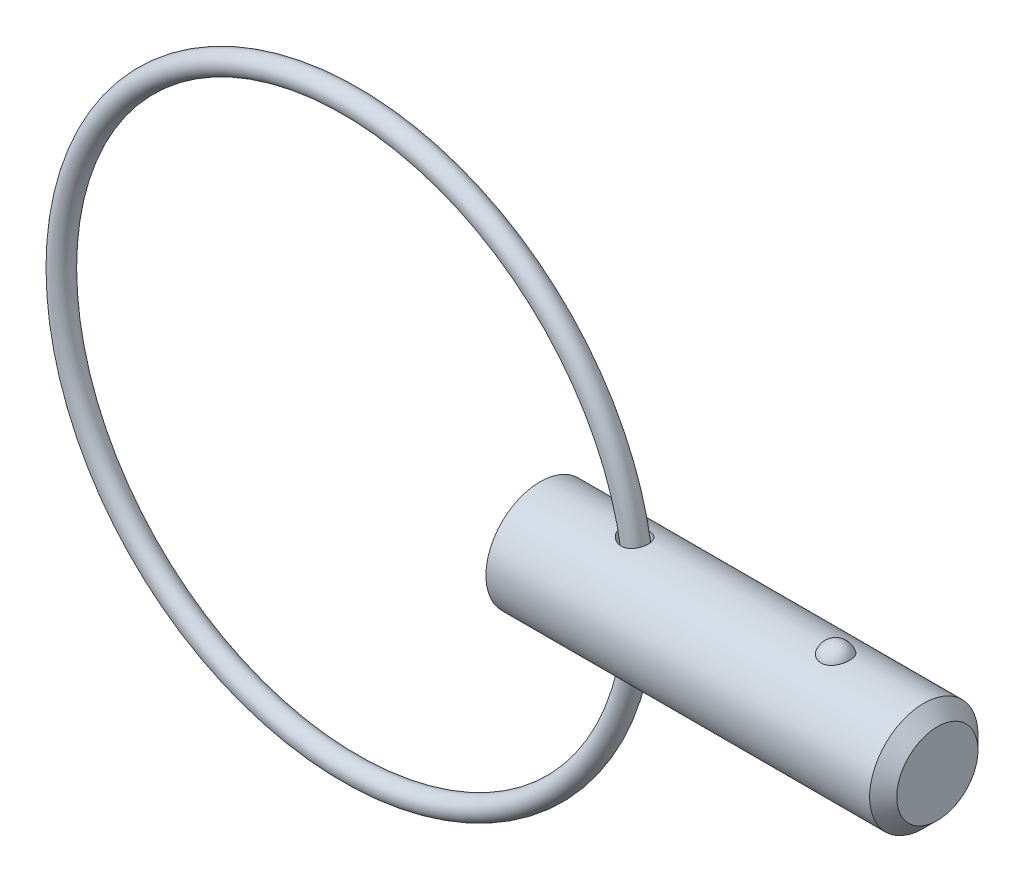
ISO-10303-21;
HEADER;
FILE_DESCRIPTION(('STEP AP214'),'2;1');
FILE_NAME('part.step','',(''),(''),'','','');
FILE_SCHEMA(('AUTOMOTIVE_DESIGN { 1 0 10303 214 1 1 1 1 }'));
ENDSEC;
DATA;
#1=APPLICATION_CONTEXT('core data for automotive mechanical design processes');
#2=APPLICATION_PROTOCOL_DEFINITION('international standard','automotive_design',2000,#1);
#3=PRODUCT_CONTEXT('',#1,'mechanical');
#4=PRODUCT('Part','Part','',(#3));
#5=PRODUCT_RELATED_PRODUCT_CATEGORY('part','',(#4));
#6=PRODUCT_DEFINITION_FORMATION('','',#4);
#7=PRODUCT_DEFINITION_CONTEXT('part definition',#1,'design');
#8=PRODUCT_DEFINITION('design','',#6,#7);
#9=PRODUCT_DEFINITION_SHAPE('','',#8);
#10=(LENGTH_UNIT() NAMED_UNIT(*) SI_UNIT(.MILLI.,.METRE.));
#11=(NAMED_UNIT(*) PLANE_ANGLE_UNIT() SI_UNIT($,.RADIAN.));
#12=(NAMED_UNIT(*) SI_UNIT($,.STERADIAN.) SOLID_ANGLE_UNIT());
#13=UNCERTAINTY_MEASURE_WITH_UNIT(LENGTH_MEASURE(1.E-05),#10,'distance_accuracy_value','');
#14=(GEOMETRIC_REPRESENTATION_CONTEXT(3) GLOBAL_UNCERTAINTY_ASSIGNED_CONTEXT((#13)) GLOBAL_UNIT_ASSIGNED_CONTEXT((#10,
#11,#12)) REPRESENTATION_CONTEXT('',''));
#15=CARTESIAN_POINT('',(0.,0.,0.));
#16=DIRECTION('',(0.,0.,1.));
#17=DIRECTION('',(1.,0.,0.));
#18=AXIS2_PLACEMENT_3D('',#15,#16,#17);
#19=CARTESIAN_POINT('',(-8.3302379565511,0.,0.));
#20=DIRECTION('',(0.,0.,1.));
#21=DIRECTION('',(1.,0.,0.));
#22=AXIS2_PLACEMENT_3D('',#19,#20,#21);
#23=TOROIDAL_SURFACE('',#22,12.7,0.476000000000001);
#24=CARTESIAN_POINT('',(4.8457620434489,0.,0.));
#25=VERTEX_POINT('',#24);
#26=VERTEX_LOOP('',#25);
#27=FACE_BOUND('',#26,.T.);
#28=ADVANCED_FACE('P0_F12',(#27),#23,.T.);
#29=CLOSED_SHELL('',(#28));
#30=MANIFOLD_SOLID_BREP('P0_B1',#29);
#31=CARTESIAN_POINT('',(0.,0.,0.));
#32=DIRECTION('',(1.,0.,0.));
#33=DIRECTION('',(0.,0.,-1.));
#34=AXIS2_PLACEMENT_3D('',#31,#32,#33);
#35=CYLINDRICAL_SURFACE('',#34,2.38);
#36=CARTESIAN_POINT('',(3.67748265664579,2.35074198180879,-0.372037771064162));
#37=CARTESIAN_POINT('',(3.70046616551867,2.34644965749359,-0.399158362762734));
#38=CARTESIAN_POINT('',(3.72581651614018,2.34199234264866,-0.424274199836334));
#39=CARTESIAN_POINT('',(3.78042747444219,2.33326580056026,-0.469907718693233));
#40=CARTESIAN_POINT('',(3.80969342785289,2.32899684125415,-0.490419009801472));
#41=CARTESIAN_POINT('',(3.87128330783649,2.32114904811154,-0.526312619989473));
#42=CARTESIAN_POINT('',(3.90360537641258,2.31756979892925,-0.541698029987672));
#43=CARTESIAN_POINT('',(3.9704452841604,2.31153734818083,-0.566889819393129));
#44=CARTESIAN_POINT('',(4.0049621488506,2.30908365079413,-0.576698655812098));
#45=CARTESIAN_POINT('',(4.07500735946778,2.30564492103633,-0.590297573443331));
#46=CARTESIAN_POINT('',(4.1105275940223,2.30465036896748,-0.594126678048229));
#47=CARTESIAN_POINT('',(4.18170718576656,2.30426876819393,-0.595606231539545));
#48=CARTESIAN_POINT('',(4.21736649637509,2.30488122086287,-0.593258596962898));
#49=CARTESIAN_POINT('',(4.28577822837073,2.30759475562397,-0.582609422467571));
#50=CARTESIAN_POINT('',(4.31858437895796,2.30961492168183,-0.57463122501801));
#51=CARTESIAN_POINT('',(4.38227060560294,2.31483318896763,-0.55323387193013));
#52=CARTESIAN_POINT('',(4.41315097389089,2.31803111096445,-0.539815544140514));
#53=CARTESIAN_POINT('',(4.4711825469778,2.3251225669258,-0.508384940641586));
#54=CARTESIAN_POINT('',(4.49841743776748,2.32899254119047,-0.490521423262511));
#55=CARTESIAN_POINT('',(4.5494826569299,2.33706025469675,-0.450515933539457));
#56=CARTESIAN_POINT('',(4.57331285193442,2.34125800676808,-0.428373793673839));
#57=CARTESIAN_POINT('',(4.6171621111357,2.34956202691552,-0.380209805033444));
#58=CARTESIAN_POINT('',(4.63714543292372,2.35366715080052,-0.354155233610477));
#59=CARTESIAN_POINT('',(4.67254725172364,2.36130301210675,-0.299034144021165));
#60=CARTESIAN_POINT('',(4.68796545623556,2.36483371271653,-0.269967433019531));
#61=CARTESIAN_POINT('',(4.71403776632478,2.37098548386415,-0.209215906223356));
#62=CARTESIAN_POINT('',(4.72462580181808,2.37359383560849,-0.177501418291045));
#63=CARTESIAN_POINT('',(4.74046966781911,2.37755210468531,-0.112692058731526));
#64=CARTESIAN_POINT('',(4.74572552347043,2.37890202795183,-0.0795971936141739));
#65=CARTESIAN_POINT('',(4.75077448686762,2.38019811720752,-0.0129544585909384));
#66=CARTESIAN_POINT('',(4.75056573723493,2.38014380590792,0.0205935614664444));
#67=CARTESIAN_POINT('',(4.74468604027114,2.37863606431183,0.087175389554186));
#68=CARTESIAN_POINT('',(4.73901506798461,2.37718262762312,0.120209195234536));
#69=CARTESIAN_POINT('',(4.72236472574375,2.37303648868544,0.184779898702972));
#70=CARTESIAN_POINT('',(4.71139268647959,2.37034549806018,0.216318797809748));
#71=CARTESIAN_POINT('',(4.68441400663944,2.36401552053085,0.277063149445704));
#72=CARTESIAN_POINT('',(4.6684071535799,2.36037649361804,0.30626850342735));
#73=CARTESIAN_POINT('',(4.63170627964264,2.35253749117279,0.361595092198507));
#74=CARTESIAN_POINT('',(4.61100040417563,2.34833610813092,0.387708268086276));
#75=CARTESIAN_POINT('',(4.56544852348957,2.33984863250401,0.43601731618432));
#76=CARTESIAN_POINT('',(4.54060272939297,2.33556254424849,0.458213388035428));
#77=CARTESIAN_POINT('',(4.48760111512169,2.32742099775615,0.497916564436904));
#78=CARTESIAN_POINT('',(4.45946763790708,2.32356294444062,0.515452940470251));
#79=CARTESIAN_POINT('',(4.40055109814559,2.31668866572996,0.545520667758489));
#80=CARTESIAN_POINT('',(4.36976845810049,2.31367230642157,0.558052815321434));
#81=CARTESIAN_POINT('',(4.30694930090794,2.30886128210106,0.577633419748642));
#82=CARTESIAN_POINT('',(4.27493988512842,2.30704826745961,0.584764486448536));
#83=CARTESIAN_POINT('',(4.21014558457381,2.30475365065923,0.593744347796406));
#84=CARTESIAN_POINT('',(4.17736068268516,2.30427207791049,0.595593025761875));
#85=CARTESIAN_POINT('',(4.11170515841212,2.30466513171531,0.59406986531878));
#86=CARTESIAN_POINT('',(4.07883545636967,2.30554895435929,0.5906626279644));
#87=CARTESIAN_POINT('',(4.01408593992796,2.30856010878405,0.578780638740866));
#88=CARTESIAN_POINT('',(3.98220636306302,2.31068773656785,0.570304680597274));
#89=CARTESIAN_POINT('',(3.91877258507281,2.31605973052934,0.548090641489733));
#90=CARTESIAN_POINT('',(3.88730095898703,2.31935100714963,0.534128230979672));
#91=CARTESIAN_POINT('',(3.82705133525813,2.32664713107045,0.501391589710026));
#92=CARTESIAN_POINT('',(3.79827429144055,2.33065222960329,0.482615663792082));
#93=CARTESIAN_POINT('',(3.7429634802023,2.3391254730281,0.439760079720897));
#94=CARTESIAN_POINT('',(3.71658313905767,2.3436062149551,0.415484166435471));
#95=CARTESIAN_POINT('',(3.6683951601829,2.35235146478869,0.362706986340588));
#96=CARTESIAN_POINT('',(3.64658727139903,2.35661598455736,0.334205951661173));
#97=CARTESIAN_POINT('',(3.60882605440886,2.36432007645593,0.27436882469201));
#98=CARTESIAN_POINT('',(3.59274982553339,2.36777633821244,0.243112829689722));
#99=CARTESIAN_POINT('',(3.56652169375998,2.3735493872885,0.178112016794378));
#100=CARTESIAN_POINT('',(3.5563653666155,2.3758670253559,0.144369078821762));
#101=CARTESIAN_POINT('',(3.54309691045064,2.37891982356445,0.0783638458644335));
#102=CARTESIAN_POINT('',(3.53947205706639,2.37976992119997,0.0462095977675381));
#103=CARTESIAN_POINT('',(3.53785288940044,2.38014795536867,-0.0182487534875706));
#104=CARTESIAN_POINT('',(3.5398575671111,2.37967612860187,-0.0505528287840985));
#105=CARTESIAN_POINT('',(3.54913867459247,2.37752661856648,-0.112617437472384));
#106=CARTESIAN_POINT('',(3.5561353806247,2.37591295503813,-0.142422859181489));
#107=CARTESIAN_POINT('',(3.5747775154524,2.37172196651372,-0.20045124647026));
#108=CARTESIAN_POINT('',(3.58642049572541,2.36914514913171,-0.228675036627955));
#109=CARTESIAN_POINT('',(3.61071901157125,2.36396321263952,-0.276620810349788));
#110=CARTESIAN_POINT('',(3.62251818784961,2.36150235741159,-0.296799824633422));
#111=CARTESIAN_POINT('',(3.64836661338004,2.35629864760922,-0.335619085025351));
#112=CARTESIAN_POINT('',(3.66241608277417,2.353555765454,-0.354259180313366));
#113=CARTESIAN_POINT('',(3.67748265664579,2.35074198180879,-0.372037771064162));
#114=B_SPLINE_CURVE_WITH_KNOTS('',3,(#36,#37,#38,#39,#40,#41,#42,#43,#44,#45,#46,#47,#48,#49,
#50,#51,#52,#53,#54,#55,#56,#57,#58,#59,#60,#61,#62,#63,#64,#65,#66,#67,#68,#69,#70,#71,#72,#73,
#74,#75,#76,#77,#78,#79,#80,#81,#82,#83,#84,#85,#86,#87,#88,#89,#90,#91,#92,#93,#94,#95,#96,#97,
#98,#99,#100,#101,#102,#103,#104,#105,#106,#107,#108,#109,#110,#111,#112,#113),.UNSPECIFIED.,
.T.,.F.,(4,2,2,2,2,2,2,2,2,2,2,2,2,2,2,2,2,2,2,2,2,2,2,2,2,2,2,2,2,2,2,2,2,2,2,2,2,2,4),(0.,
0.107335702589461,0.214819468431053,0.322238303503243,0.429609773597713,0.536277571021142,
0.642912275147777,0.743874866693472,0.844822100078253,0.942762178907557,1.04070609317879,
1.13952022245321,1.23834068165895,1.33847507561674,1.43860899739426,1.53877695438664,
1.63894536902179,1.73897565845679,1.83901017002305,1.93929990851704,2.03958453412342,
2.13922343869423,2.23884648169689,2.33691317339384,2.43498203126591,2.53371427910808,
2.63247003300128,2.73577311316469,2.83911262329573,2.94697761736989,3.05483668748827,
3.16021984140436,3.2655241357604,3.36212700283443,3.45871257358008,3.55027266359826,
3.64178456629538,3.71214035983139,3.78250304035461),.UNSPECIFIED.);
#115=CARTESIAN_POINT('',(3.67748265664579,2.35074198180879,-0.372037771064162));
#116=VERTEX_POINT('',#115);
#117=EDGE_CURVE('P1_E40',#116,#116,#114,.T.);
#118=ORIENTED_EDGE('',*,*,#117,.T.);
#119=EDGE_LOOP('',(#118));
#120=FACE_BOUND('',#119,.T.);
#121=CARTESIAN_POINT('',(16.855,0.,0.));
#122=DIRECTION('',(1.,0.,0.));
#123=DIRECTION('',(0.,0.,-1.));
#124=AXIS2_PLACEMENT_3D('',#121,#122,#123);
#125=CIRCLE('',#124,2.38);
#126=CARTESIAN_POINT('',(16.855,0.,-2.38));
#127=VERTEX_POINT('',#126);
#128=EDGE_CURVE('P1_E25',#127,#127,#125,.T.);
#129=ORIENTED_EDGE('',*,*,#128,.F.);
#130=EDGE_LOOP('',(#129));
#131=FACE_BOUND('',#130,.T.);
#132=CARTESIAN_POINT('',(0.,0.,0.));
#133=DIRECTION('',(1.,0.,0.));
#134=DIRECTION('',(0.,0.,-1.));
#135=AXIS2_PLACEMENT_3D('',#132,#133,#134);
#136=CIRCLE('',#135,2.38);
#137=CARTESIAN_POINT('',(0.,0.,-2.38));
#138=VERTEX_POINT('',#137);
#139=EDGE_CURVE('P1_E9',#138,#138,#136,.T.);
#140=ORIENTED_EDGE('',*,*,#139,.T.);
#141=EDGE_LOOP('',(#140));
#142=FACE_BOUND('',#141,.T.);
#143=CARTESIAN_POINT('',(12.9834492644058,2.2921568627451,0.640637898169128));
#144=CARTESIAN_POINT('',(12.9503559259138,2.29215737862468,0.640637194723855));
#145=CARTESIAN_POINT('',(12.9172546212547,2.29293179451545,0.637884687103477));
#146=CARTESIAN_POINT('',(12.8520176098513,2.29594030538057,0.626968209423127));
#147=CARTESIAN_POINT('',(12.8198823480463,2.29817506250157,0.618801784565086));
#148=CARTESIAN_POINT('',(12.7575402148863,2.30384308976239,0.597351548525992));
#149=CARTESIAN_POINT('',(12.7273305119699,2.30727454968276,0.584075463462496));
#150=CARTESIAN_POINT('',(12.6695674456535,2.31495941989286,0.55282960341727));
#151=CARTESIAN_POINT('',(12.6420141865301,2.31921286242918,0.534859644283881));
#152=CARTESIAN_POINT('',(12.5895938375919,2.32820213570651,0.494282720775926));
#153=CARTESIAN_POINT('',(12.5648050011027,2.33294694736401,0.471576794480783));
#154=CARTESIAN_POINT('',(12.5192169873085,2.34234144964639,0.422446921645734));
#155=CARTESIAN_POINT('',(12.4984185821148,2.34699112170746,0.396022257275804));
#156=CARTESIAN_POINT('',(12.4603580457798,2.35593942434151,0.338855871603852));
#157=CARTESIAN_POINT('',(12.4433051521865,2.36021170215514,0.307970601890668));
#158=CARTESIAN_POINT('',(12.4143607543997,2.3677057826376,0.243750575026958));
#159=CARTESIAN_POINT('',(12.4024701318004,2.37092740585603,0.210415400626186));
#160=CARTESIAN_POINT('',(12.3838076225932,2.37606901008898,0.141189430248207));
#161=CARTESIAN_POINT('',(12.3771956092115,2.37794816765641,0.105252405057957));
#162=CARTESIAN_POINT('',(12.3698095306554,2.38005135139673,0.0327351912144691));
#163=CARTESIAN_POINT('',(12.3690358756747,2.38027526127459,-0.00384504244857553));
#164=CARTESIAN_POINT('',(12.3733628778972,2.37903842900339,-0.0769838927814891));
#165=CARTESIAN_POINT('',(12.3785202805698,2.37756141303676,-0.113538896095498));
#166=CARTESIAN_POINT('',(12.3947013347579,2.37305303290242,-0.185229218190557));
#167=CARTESIAN_POINT('',(12.4057251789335,2.37002161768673,-0.220364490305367));
#168=CARTESIAN_POINT('',(12.4333977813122,2.36273722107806,-0.288156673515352));
#169=CARTESIAN_POINT('',(12.4500389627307,2.35848588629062,-0.320816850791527));
#170=CARTESIAN_POINT('',(12.4885984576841,2.34923130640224,-0.382744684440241));
#171=CARTESIAN_POINT('',(12.510516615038,2.34422808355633,-0.412012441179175));
#172=CARTESIAN_POINT('',(12.5587549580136,2.33412555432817,-0.465830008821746));
#173=CARTESIAN_POINT('',(12.5850028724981,2.32902887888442,-0.490444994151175));
#174=CARTESIAN_POINT('',(12.6414769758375,2.31926941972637,-0.534700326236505));
#175=CARTESIAN_POINT('',(12.671702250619,2.3146065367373,-0.55434181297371));
#176=CARTESIAN_POINT('',(12.7340618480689,2.30645675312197,-0.587312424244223));
#177=CARTESIAN_POINT('',(12.7660780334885,2.30293152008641,-0.600855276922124));
#178=CARTESIAN_POINT('',(12.8320795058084,2.29725171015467,-0.622220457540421));
#179=CARTESIAN_POINT('',(12.8660641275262,2.29509667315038,-0.630044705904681));
#180=CARTESIAN_POINT('',(12.933299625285,2.29249264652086,-0.639452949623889));
#181=CARTESIAN_POINT('',(12.9665087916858,2.29196755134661,-0.641315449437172));
#182=CARTESIAN_POINT('',(13.032763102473,2.29246849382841,-0.639522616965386));
#183=CARTESIAN_POINT('',(13.0658082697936,2.29349430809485,-0.635868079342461));
#184=CARTESIAN_POINT('',(13.1301025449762,2.29694059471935,-0.623301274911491));
#185=CARTESIAN_POINT('',(13.1613744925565,2.29933234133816,-0.614497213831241));
#186=CARTESIAN_POINT('',(13.2219952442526,2.30522511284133,-0.592006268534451));
#187=CARTESIAN_POINT('',(13.2513438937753,2.30872622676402,-0.578318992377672));
#188=CARTESIAN_POINT('',(13.3080369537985,2.31655795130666,-0.546112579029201));
#189=CARTESIAN_POINT('',(13.3353201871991,2.32090569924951,-0.527490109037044));
#190=CARTESIAN_POINT('',(13.3864904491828,2.32992206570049,-0.486117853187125));
#191=CARTESIAN_POINT('',(13.4103767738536,2.33459075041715,-0.463367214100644));
#192=CARTESIAN_POINT('',(13.4552722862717,2.34399834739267,-0.413220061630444));
#193=CARTESIAN_POINT('',(13.4760972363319,2.34873051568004,-0.385657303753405));
#194=CARTESIAN_POINT('',(13.513056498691,2.35754932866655,-0.327455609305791));
#195=CARTESIAN_POINT('',(13.5291898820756,2.36163584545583,-0.296816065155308));
#196=CARTESIAN_POINT('',(13.5569822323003,2.36889321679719,-0.232047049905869));
#197=CARTESIAN_POINT('',(13.5684450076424,2.37202275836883,-0.197828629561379));
#198=CARTESIAN_POINT('',(13.5857523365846,2.37681926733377,-0.127900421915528));
#199=CARTESIAN_POINT('',(13.5915962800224,2.37848607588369,-0.0921904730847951));
#200=CARTESIAN_POINT('',(13.5976051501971,2.38020024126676,-0.0196348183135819));
#201=CARTESIAN_POINT('',(13.5976704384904,2.38021918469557,0.0172198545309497));
#202=CARTESIAN_POINT('',(13.5918689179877,2.37856356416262,0.0904219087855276));
#203=CARTESIAN_POINT('',(13.5860018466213,2.37688892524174,0.126769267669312));
#204=CARTESIAN_POINT('',(13.568425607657,2.37201688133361,0.198028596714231));
#205=CARTESIAN_POINT('',(13.556699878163,2.36881516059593,0.232936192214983));
#206=CARTESIAN_POINT('',(13.5276354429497,2.36123444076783,0.300196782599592));
#207=CARTESIAN_POINT('',(13.5102967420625,2.3568554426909,0.332549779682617));
#208=CARTESIAN_POINT('',(13.4705350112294,2.34744667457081,0.393495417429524));
#209=CARTESIAN_POINT('',(13.4481528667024,2.34242227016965,0.42211552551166));
#210=CARTESIAN_POINT('',(13.3987391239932,2.33227293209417,0.475004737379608));
#211=CARTESIAN_POINT('',(13.3717076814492,2.32714800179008,0.499273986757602));
#212=CARTESIAN_POINT('',(13.3144988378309,2.31755359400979,0.542046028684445));
#213=CARTESIAN_POINT('',(13.2844297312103,2.3130698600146,0.560690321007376));
#214=CARTESIAN_POINT('',(13.2213869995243,2.3051412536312,0.592447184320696));
#215=CARTESIAN_POINT('',(13.1884158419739,2.30169550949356,0.605564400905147));
#216=CARTESIAN_POINT('',(13.1268424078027,2.29677744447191,0.623927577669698));
#217=CARTESIAN_POINT('',(13.0985555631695,2.29505839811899,0.630178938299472));
#218=CARTESIAN_POINT('',(13.0413308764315,2.29274795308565,0.638534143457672));
#219=CARTESIAN_POINT('',(13.0123931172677,2.29215641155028,0.64063851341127));
#220=CARTESIAN_POINT('',(12.9834492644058,2.2921568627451,0.640637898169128));
#221=B_SPLINE_CURVE_WITH_KNOTS('',3,(#143,#144,#145,#146,#147,#148,#149,#150,#151,#152,#153,
#154,#155,#156,#157,#158,#159,#160,#161,#162,#163,#164,#165,#166,#167,#168,#169,#170,#171,#172,
#173,#174,#175,#176,#177,#178,#179,#180,#181,#182,#183,#184,#185,#186,#187,#188,#189,#190,#191,
#192,#193,#194,#195,#196,#197,#198,#199,#200,#201,#202,#203,#204,#205,#206,#207,#208,#209,#210,
#211,#212,#213,#214,#215,#216,#217,#218,#219,#220),.UNSPECIFIED.,.T.,.F.,(4,2,2,2,2,2,2,2,2,2,2,
2,2,2,2,2,2,2,2,2,2,2,2,2,2,2,2,2,2,2,2,2,2,2,2,2,2,2,4),(0.,0.0991724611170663,
0.198389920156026,0.297457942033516,0.396529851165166,0.497927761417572,0.599345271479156,
0.705475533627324,0.811623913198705,0.920876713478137,1.03013718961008,1.14045177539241,
1.25076998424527,1.3609399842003,1.47110672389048,1.57959248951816,1.6880533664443,
1.79234266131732,1.89659691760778,1.99590391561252,2.0951966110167,2.19247425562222,
2.28975970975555,2.38926978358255,2.48880044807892,2.59293588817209,2.69709193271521,
2.80525821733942,2.91343624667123,3.02347917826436,3.13352698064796,3.24388765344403,
3.35424823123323,3.46374443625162,3.57323697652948,3.67968690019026,3.78604717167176,
3.87279565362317,3.95953314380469),.UNSPECIFIED.);
#222=CARTESIAN_POINT('',(12.9834492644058,2.2921568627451,0.640637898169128));
#223=VERTEX_POINT('',#222);
#224=EDGE_CURVE('P1_E34',#223,#223,#221,.T.);
#225=ORIENTED_EDGE('',*,*,#224,.T.);
#226=EDGE_LOOP('',(#225));
#227=FACE_BOUND('',#226,.T.);
#228=CARTESIAN_POINT('',(3.67748265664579,-2.35074198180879,-0.372037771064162));
#229=CARTESIAN_POINT('',(3.65652023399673,-2.35465684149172,-0.34730037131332));
#230=CARTESIAN_POINT('',(3.63751328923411,-2.35843676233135,-0.320880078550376));
#231=CARTESIAN_POINT('',(3.60404107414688,-2.36534227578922,-0.265218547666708));
#232=CARTESIAN_POINT('',(3.58957485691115,-2.36846800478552,-0.235977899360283));
#233=CARTESIAN_POINT('',(3.56572865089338,-2.37373250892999,-0.17528149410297));
#234=CARTESIAN_POINT('',(3.55636565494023,-2.37586798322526,-0.143818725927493));
#235=CARTESIAN_POINT('',(3.54325775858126,-2.37888184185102,-0.0796854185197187));
#236=CARTESIAN_POINT('',(3.539510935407,-2.37976065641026,-0.0470152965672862));
#237=CARTESIAN_POINT('',(3.53787230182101,-2.38014359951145,0.0167788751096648));
#238=CARTESIAN_POINT('',(3.53968714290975,-2.37971660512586,0.0478953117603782));
#239=CARTESIAN_POINT('',(3.54844977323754,-2.37768530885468,0.109352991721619));
#240=CARTESIAN_POINT('',(3.55539746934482,-2.37608102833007,0.139694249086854));
#241=CARTESIAN_POINT('',(3.57400783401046,-2.37189301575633,0.198451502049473));
#242=CARTESIAN_POINT('',(3.58561918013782,-2.36931996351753,0.226884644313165));
#243=CARTESIAN_POINT('',(3.61310377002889,-2.36345094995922,0.281524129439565));
#244=CARTESIAN_POINT('',(3.62897804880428,-2.36015481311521,0.30772992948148));
#245=CARTESIAN_POINT('',(3.66562367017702,-2.35291979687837,0.359001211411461));
#246=CARTESIAN_POINT('',(3.68664499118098,-2.34895316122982,0.383883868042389));
#247=CARTESIAN_POINT('',(3.73230875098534,-2.34094029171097,0.430056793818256));
#248=CARTESIAN_POINT('',(3.75695270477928,-2.33689402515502,0.451345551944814));
#249=CARTESIAN_POINT('',(3.81128123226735,-2.32880869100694,0.491427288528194));
#250=CARTESIAN_POINT('',(3.84120889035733,-2.32479472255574,0.509896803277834));
#251=CARTESIAN_POINT('',(3.90376464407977,-2.31758417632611,0.541729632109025));
#252=CARTESIAN_POINT('',(3.93639323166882,-2.31438774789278,0.555092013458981));
#253=CARTESIAN_POINT('',(4.00416670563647,-2.30915137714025,0.576493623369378));
#254=CARTESIAN_POINT('',(4.0393485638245,-2.30713552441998,0.584422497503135));
#255=CARTESIAN_POINT('',(4.11060438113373,-2.30465258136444,0.594140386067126));
#256=CARTESIAN_POINT('',(4.14667802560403,-2.30418495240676,0.595931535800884));
#257=CARTESIAN_POINT('',(4.21693481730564,-2.30488473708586,0.593218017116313));
#258=CARTESIAN_POINT('',(4.25112951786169,-2.3059789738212,0.588995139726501));
#259=CARTESIAN_POINT('',(4.31821509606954,-2.30956729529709,0.57476284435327));
#260=CARTESIAN_POINT('',(4.35110629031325,-2.31206103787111,0.564754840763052));
#261=CARTESIAN_POINT('',(4.41316900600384,-2.31802118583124,0.53975368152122));
#262=CARTESIAN_POINT('',(4.44243993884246,-2.32144077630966,0.524995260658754));
#263=CARTESIAN_POINT('',(4.49802365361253,-2.32890801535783,0.49080792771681));
#264=CARTESIAN_POINT('',(4.52433643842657,-2.33295566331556,0.471379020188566));
#265=CARTESIAN_POINT('',(4.57327790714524,-2.3412242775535,0.428422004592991));
#266=CARTESIAN_POINT('',(4.59591094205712,-2.34544503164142,0.404898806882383));
#267=CARTESIAN_POINT('',(4.63697038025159,-2.35360640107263,0.354387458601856));
#268=CARTESIAN_POINT('',(4.65539647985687,-2.35754699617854,0.327399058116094));
#269=CARTESIAN_POINT('',(4.68784943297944,-2.36478461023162,0.270249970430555));
#270=CARTESIAN_POINT('',(4.70180333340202,-2.36807065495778,0.240046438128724));
#271=CARTESIAN_POINT('',(4.72457181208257,-2.3735656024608,0.177668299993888));
#272=CARTESIAN_POINT('',(4.73338630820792,-2.37577448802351,0.145493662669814));
#273=CARTESIAN_POINT('',(4.74568442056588,-2.37888446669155,0.0799353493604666));
#274=CARTESIAN_POINT('',(4.74914498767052,-2.37977990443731,0.0465470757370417));
#275=CARTESIAN_POINT('',(4.75057509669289,-2.38014803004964,-0.0203543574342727));
#276=CARTESIAN_POINT('',(4.74854468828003,-2.37962073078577,-0.0538675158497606));
#277=CARTESIAN_POINT('',(4.73905606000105,-2.37720346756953,-0.119981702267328));
#278=CARTESIAN_POINT('',(4.73161109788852,-2.37531683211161,-0.152584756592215));
#279=CARTESIAN_POINT('',(4.71149336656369,-2.37038779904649,-0.216044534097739));
#280=CARTESIAN_POINT('',(4.69882040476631,-2.36734535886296,-0.246901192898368));
#281=CARTESIAN_POINT('',(4.66852750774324,-2.3604270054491,-0.306062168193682));
#282=CARTESIAN_POINT('',(4.65089743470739,-2.35654938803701,-0.334361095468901));
#283=CARTESIAN_POINT('',(4.61113860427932,-2.34839114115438,-0.387535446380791));
#284=CARTESIAN_POINT('',(4.5890098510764,-2.34411051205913,-0.412410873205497));
#285=CARTESIAN_POINT('',(4.54086484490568,-2.33563475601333,-0.457982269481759));
#286=CARTESIAN_POINT('',(4.51485596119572,-2.33143948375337,-0.478685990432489));
#287=CARTESIAN_POINT('',(4.45962330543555,-2.32360655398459,-0.515369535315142));
#288=CARTESIAN_POINT('',(4.43040000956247,-2.31996881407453,-0.531350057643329));
#289=CARTESIAN_POINT('',(4.37002624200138,-2.31371771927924,-0.557938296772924));
#290=CARTESIAN_POINT('',(4.33891082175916,-2.31108995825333,-0.568622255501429));
#291=CARTESIAN_POINT('',(4.27527207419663,-2.30707117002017,-0.584715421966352));
#292=CARTESIAN_POINT('',(4.24274884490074,-2.30568005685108,-0.590124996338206));
#293=CARTESIAN_POINT('',(4.17738918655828,-2.30427145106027,-0.595601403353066));
#294=CARTESIAN_POINT('',(4.14455499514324,-2.3042474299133,-0.595693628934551));
#295=CARTESIAN_POINT('',(4.07930726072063,-2.30552664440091,-0.590722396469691));
#296=CARTESIAN_POINT('',(4.04689380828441,-2.3068301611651,-0.585657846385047));
#297=CARTESIAN_POINT('',(3.98220150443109,-2.31066076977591,-0.570360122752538));
#298=CARTESIAN_POINT('',(3.94996602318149,-2.31322859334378,-0.559954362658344));
#299=CARTESIAN_POINT('',(3.88760707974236,-2.31930140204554,-0.534242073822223));
#300=CARTESIAN_POINT('',(3.85748403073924,-2.32280656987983,-0.518934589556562));
#301=CARTESIAN_POINT('',(3.80033132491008,-2.33034138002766,-0.483968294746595));
#302=CARTESIAN_POINT('',(3.77327623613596,-2.33436601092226,-0.46434994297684));
#303=CARTESIAN_POINT('',(3.72262060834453,-2.34255524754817,-0.421092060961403));
#304=CARTESIAN_POINT('',(3.69901956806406,-2.34671983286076,-0.397453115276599));
#305=CARTESIAN_POINT('',(3.67748265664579,-2.35074198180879,-0.372037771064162));
#306=B_SPLINE_CURVE_WITH_KNOTS('',3,(#228,#229,#230,#231,#232,#233,#234,#235,#236,#237,#238,
#239,#240,#241,#242,#243,#244,#245,#246,#247,#248,#249,#250,#251,#252,#253,#254,#255,#256,#257,
#258,#259,#260,#261,#262,#263,#264,#265,#266,#267,#268,#269,#270,#271,#272,#273,#274,#275,#276,
#277,#278,#279,#280,#281,#282,#283,#284,#285,#286,#287,#288,#289,#290,#291,#292,#293,#294,#295,
#296,#297,#298,#299,#300,#301,#302,#303,#304,#305),.UNSPECIFIED.,.T.,.F.,(4,2,2,2,2,2,2,2,2,2,2,
2,2,2,2,2,2,2,2,2,2,2,2,2,2,2,2,2,2,2,2,2,2,2,2,2,2,2,4),(0.,0.0978755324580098,
0.195730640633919,0.293909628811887,0.39205499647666,0.485114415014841,0.578172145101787,
0.670232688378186,0.762315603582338,0.860342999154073,0.958411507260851,1.06411708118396,
1.16984195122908,1.27765506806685,1.38543067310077,1.48831936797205,1.59118291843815,
1.68959047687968,1.78799793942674,1.88628818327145,1.98458551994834,2.08441314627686,
2.18424236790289,2.28450017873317,2.3847570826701,2.4847693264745,2.58478525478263,
2.68500723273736,2.78522911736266,2.8852630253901,2.98528213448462,3.08381637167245,
3.18234375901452,3.28040059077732,3.37847819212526,3.47994551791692,3.58143263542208,
3.68200512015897,3.78256299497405),.UNSPECIFIED.);
#307=CARTESIAN_POINT('',(3.67748265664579,-2.35074198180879,-0.372037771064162));
#308=VERTEX_POINT('',#307);
#309=EDGE_CURVE('P1_E17',#308,#308,#306,.T.);
#310=ORIENTED_EDGE('',*,*,#309,.T.);
#311=EDGE_LOOP('',(#310));
#312=FACE_BOUND('',#311,.T.);
#313=ADVANCED_FACE('P1_F13',(#120,#131,#142,#227,#312),#35,.T.);
#314=CARTESIAN_POINT('',(0.,0.,0.));
#315=DIRECTION('',(-1.,0.,0.));
#316=DIRECTION('',(0.,0.,1.));
#317=AXIS2_PLACEMENT_3D('',#314,#315,#316);
#318=PLANE('',#317);
#319=ORIENTED_EDGE('',*,*,#139,.F.);
#320=EDGE_LOOP('',(#319));
#321=FACE_BOUND('',#320,.T.);
#322=ADVANCED_FACE('P1_F15',(#321),#318,.T.);
#323=CARTESIAN_POINT('',(17.45,0.,0.));
#324=DIRECTION('',(-1.,0.,0.));
#325=DIRECTION('',(0.,0.,1.));
#326=AXIS2_PLACEMENT_3D('',#323,#324,#325);
#327=CONICAL_SURFACE('',#326,1.785,0.785398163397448);
#328=ORIENTED_EDGE('',*,*,#128,.T.);
#329=EDGE_LOOP('',(#328));
#330=FACE_BOUND('',#329,.T.);
#331=CARTESIAN_POINT('',(17.45,0.,0.));
#332=DIRECTION('',(1.,0.,0.));
#333=DIRECTION('',(0.,0.,-1.));
#334=AXIS2_PLACEMENT_3D('',#331,#332,#333);
#335=CIRCLE('',#334,1.785);
#336=CARTESIAN_POINT('',(17.45,0.,-1.785));
#337=VERTEX_POINT('',#336);
#338=EDGE_CURVE('P1_E30',#337,#337,#335,.T.);
#339=ORIENTED_EDGE('',*,*,#338,.F.);
#340=EDGE_LOOP('',(#339));
#341=FACE_BOUND('',#340,.T.);
#342=ADVANCED_FACE('P1_F55',(#330,#341),#327,.T.);
#343=CARTESIAN_POINT('',(17.45,1.785,0.));
#344=DIRECTION('',(1.,0.,0.));
#345=DIRECTION('',(0.,0.,-1.));
#346=AXIS2_PLACEMENT_3D('',#343,#344,#345);
#347=PLANE('',#346);
#348=ORIENTED_EDGE('',*,*,#338,.T.);
#349=EDGE_LOOP('',(#348));
#350=FACE_BOUND('',#349,.T.);
#351=ADVANCED_FACE('P1_F51',(#350),#347,.T.);
#352=CARTESIAN_POINT('',(12.9834492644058,2.142,0.));
#353=DIRECTION('',(-1.,0.,0.));
#354=DIRECTION('',(0.,1.,0.));
#355=AXIS2_PLACEMENT_3D('',#352,#353,#354);
#356=SPHERICAL_SURFACE('',#355,0.658000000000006);
#357=ORIENTED_EDGE('',*,*,#224,.F.);
#358=EDGE_LOOP('',(#357));
#359=FACE_BOUND('',#358,.T.);
#360=ADVANCED_FACE('P1_F46',(#359),#356,.T.);
#361=CARTESIAN_POINT('',(-8.3302379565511,0.,0.));
#362=DIRECTION('',(0.,0.,1.));
#363=DIRECTION('',(1.,0.,0.));
#364=AXIS2_PLACEMENT_3D('',#361,#362,#363);
#365=TOROIDAL_SURFACE('',#364,12.7,0.594999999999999);
#366=ORIENTED_EDGE('',*,*,#309,.F.);
#367=EDGE_LOOP('',(#366));
#368=FACE_BOUND('',#367,.T.);
#369=ORIENTED_EDGE('',*,*,#117,.F.);
#370=EDGE_LOOP('',(#369));
#371=FACE_BOUND('',#370,.T.);
#372=ADVANCED_FACE('P1_F50',(#368,#371),#365,.F.);
#373=CLOSED_SHELL('',(#313,#322,#342,#351,#360,#372));
#374=MANIFOLD_SOLID_BREP('P1_B1',#373);
#375=ADVANCED_BREP_SHAPE_REPRESENTATION('',(#18,#30,#374),#14);
#376=SHAPE_DEFINITION_REPRESENTATION(#9,#375);
ENDSEC;
END-ISO-10303-21;
